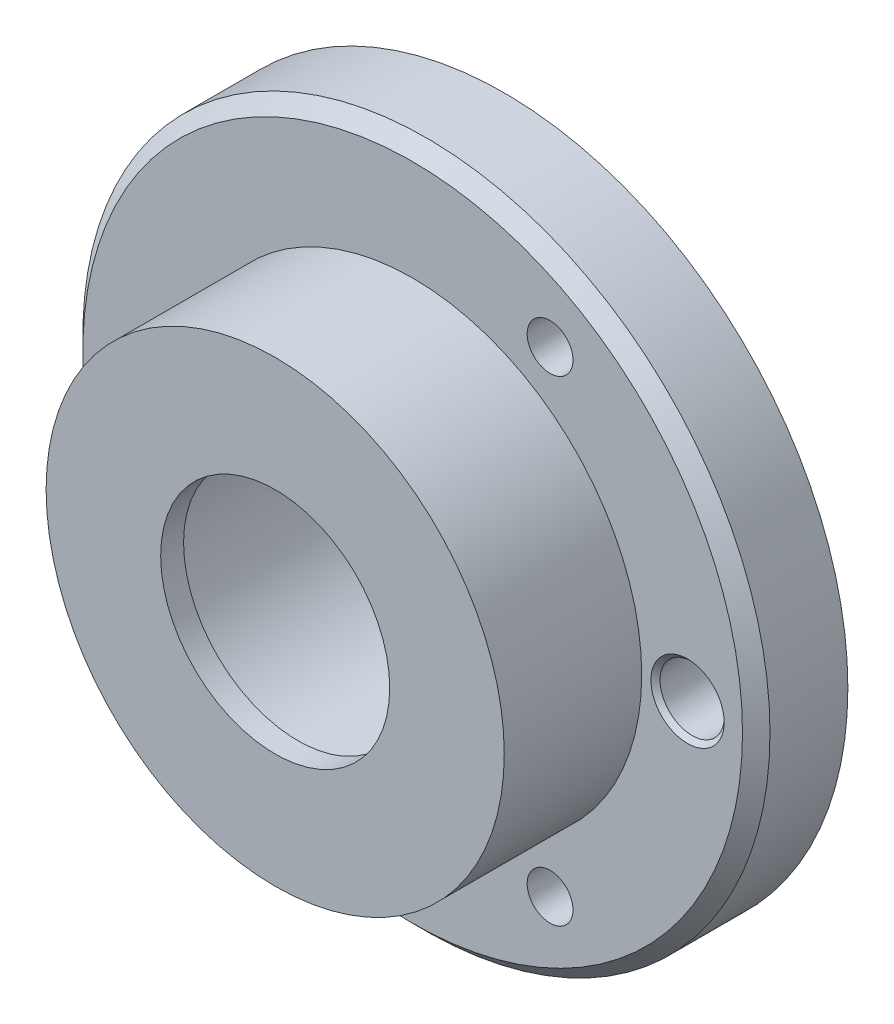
ISO-10303-21;
HEADER;
FILE_DESCRIPTION(('STEP AP214'),'2;1');
FILE_NAME('part.step','',(''),(''),'','','');
FILE_SCHEMA(('AUTOMOTIVE_DESIGN { 1 0 10303 214 1 1 1 1 }'));
ENDSEC;
DATA;
#1=APPLICATION_CONTEXT('core data for automotive mechanical design processes');
#2=APPLICATION_PROTOCOL_DEFINITION('international standard','automotive_design',2000,#1);
#3=PRODUCT_CONTEXT('',#1,'mechanical');
#4=PRODUCT('Part','Part','',(#3));
#5=PRODUCT_RELATED_PRODUCT_CATEGORY('part','',(#4));
#6=PRODUCT_DEFINITION_FORMATION('','',#4);
#7=PRODUCT_DEFINITION_CONTEXT('part definition',#1,'design');
#8=PRODUCT_DEFINITION('design','',#6,#7);
#9=PRODUCT_DEFINITION_SHAPE('','',#8);
#10=(LENGTH_UNIT() NAMED_UNIT(*) SI_UNIT(.MILLI.,.METRE.));
#11=(NAMED_UNIT(*) PLANE_ANGLE_UNIT() SI_UNIT($,.RADIAN.));
#12=(NAMED_UNIT(*) SI_UNIT($,.STERADIAN.) SOLID_ANGLE_UNIT());
#13=UNCERTAINTY_MEASURE_WITH_UNIT(LENGTH_MEASURE(1.E-05),#10,'distance_accuracy_value','');
#14=(GEOMETRIC_REPRESENTATION_CONTEXT(3) GLOBAL_UNCERTAINTY_ASSIGNED_CONTEXT((#13)) GLOBAL_UNIT_ASSIGNED_CONTEXT((#10,
#11,#12)) REPRESENTATION_CONTEXT('',''));
#15=CARTESIAN_POINT('',(0.,0.,0.));
#16=DIRECTION('',(0.,0.,1.));
#17=DIRECTION('',(1.,0.,0.));
#18=AXIS2_PLACEMENT_3D('',#15,#16,#17);
#19=CARTESIAN_POINT('',(0.,0.,-0.00100000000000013));
#20=DIRECTION('',(0.,0.,1.));
#21=DIRECTION('',(1.,0.,0.));
#22=AXIS2_PLACEMENT_3D('',#19,#20,#21);
#23=CYLINDRICAL_SURFACE('',#22,2.5);
#24=CARTESIAN_POINT('',(0.,0.,5.));
#25=DIRECTION('',(0.,0.,1.));
#26=DIRECTION('',(1.,0.,0.));
#27=AXIS2_PLACEMENT_3D('',#24,#25,#26);
#28=CIRCLE('',#27,2.5);
#29=CARTESIAN_POINT('',(2.5,0.,5.));
#30=VERTEX_POINT('',#29);
#31=EDGE_CURVE('E84',#30,#30,#28,.T.);
#32=ORIENTED_EDGE('',*,*,#31,.T.);
#33=EDGE_LOOP('',(#32));
#34=FACE_BOUND('',#33,.T.);
#35=CARTESIAN_POINT('',(0.,0.,4.5));
#36=DIRECTION('',(0.,0.,-1.));
#37=DIRECTION('',(-1.,0.,0.));
#38=AXIS2_PLACEMENT_3D('',#35,#36,#37);
#39=CIRCLE('',#38,2.5);
#40=CARTESIAN_POINT('',(-2.5,0.,4.5));
#41=VERTEX_POINT('',#40);
#42=EDGE_CURVE('E81',#41,#41,#39,.F.);
#43=ORIENTED_EDGE('',*,*,#42,.F.);
#44=EDGE_LOOP('',(#43));
#45=FACE_BOUND('',#44,.T.);
#46=ADVANCED_FACE('F30',(#34,#45),#23,.F.);
#47=CARTESIAN_POINT('',(0.,0.,2.));
#48=DIRECTION('',(0.,0.,1.));
#49=DIRECTION('',(1.,0.,0.));
#50=AXIS2_PLACEMENT_3D('',#47,#48,#49);
#51=PLANE('',#50);
#52=CARTESIAN_POINT('',(6.,0.,2.));
#53=DIRECTION('',(0.,0.,1.));
#54=DIRECTION('',(1.,0.,0.));
#55=AXIS2_PLACEMENT_3D('',#52,#53,#54);
#56=CIRCLE('',#55,0.8);
#57=CARTESIAN_POINT('',(6.8,0.,2.));
#58=VERTEX_POINT('',#57);
#59=EDGE_CURVE('E10',#58,#58,#56,.F.);
#60=ORIENTED_EDGE('',*,*,#59,.T.);
#61=EDGE_LOOP('',(#60));
#62=FACE_BOUND('',#61,.T.);
#63=CARTESIAN_POINT('',(0.,0.,2.));
#64=DIRECTION('',(0.,0.,1.));
#65=DIRECTION('',(1.,0.,0.));
#66=AXIS2_PLACEMENT_3D('',#63,#64,#65);
#67=CIRCLE('',#66,7.2);
#68=CARTESIAN_POINT('',(7.2,0.,2.));
#69=VERTEX_POINT('',#68);
#70=EDGE_CURVE('E77',#69,#69,#67,.T.);
#71=ORIENTED_EDGE('',*,*,#70,.T.);
#72=EDGE_LOOP('',(#71));
#73=FACE_BOUND('',#72,.T.);
#74=CARTESIAN_POINT('',(2.99999999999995,5.19615242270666,2.));
#75=DIRECTION('',(0.,0.,1.));
#76=DIRECTION('',(1.,0.,0.));
#77=AXIS2_PLACEMENT_3D('',#74,#75,#76);
#78=CIRCLE('',#77,0.500000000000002);
#79=CARTESIAN_POINT('',(3.49999999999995,5.19615242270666,2.));
#80=VERTEX_POINT('',#79);
#81=EDGE_CURVE('E104',#80,#80,#78,.T.);
#82=ORIENTED_EDGE('',*,*,#81,.F.);
#83=EDGE_LOOP('',(#82));
#84=FACE_BOUND('',#83,.T.);
#85=CARTESIAN_POINT('',(3.00000000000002,-5.19615242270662,2.));
#86=DIRECTION('',(0.,0.,1.));
#87=DIRECTION('',(1.,0.,0.));
#88=AXIS2_PLACEMENT_3D('',#85,#86,#87);
#89=CIRCLE('',#88,0.500000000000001);
#90=CARTESIAN_POINT('',(3.50000000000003,-5.19615242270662,2.));
#91=VERTEX_POINT('',#90);
#92=EDGE_CURVE('E101',#91,#91,#89,.T.);
#93=ORIENTED_EDGE('',*,*,#92,.F.);
#94=EDGE_LOOP('',(#93));
#95=FACE_BOUND('',#94,.T.);
#96=CARTESIAN_POINT('',(-6.,0.,2.));
#97=DIRECTION('',(0.,0.,1.));
#98=DIRECTION('',(1.,0.,0.));
#99=AXIS2_PLACEMENT_3D('',#96,#97,#98);
#100=CIRCLE('',#99,0.500000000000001);
#101=CARTESIAN_POINT('',(-5.5,0.,2.));
#102=VERTEX_POINT('',#101);
#103=EDGE_CURVE('E98',#102,#102,#100,.T.);
#104=ORIENTED_EDGE('',*,*,#103,.F.);
#105=EDGE_LOOP('',(#104));
#106=FACE_BOUND('',#105,.T.);
#107=CARTESIAN_POINT('',(0.,0.,2.));
#108=DIRECTION('',(0.,0.,1.));
#109=DIRECTION('',(1.,0.,0.));
#110=AXIS2_PLACEMENT_3D('',#107,#108,#109);
#111=CIRCLE('',#110,5.);
#112=CARTESIAN_POINT('',(5.,0.,2.));
#113=VERTEX_POINT('',#112);
#114=EDGE_CURVE('E91',#113,#113,#111,.T.);
#115=ORIENTED_EDGE('',*,*,#114,.F.);
#116=EDGE_LOOP('',(#115));
#117=FACE_BOUND('',#116,.T.);
#118=ADVANCED_FACE('F110',(#62,#73,#84,#95,#106,#117),#51,.T.);
#119=CARTESIAN_POINT('',(0.,0.,2.));
#120=DIRECTION('',(0.,0.,-1.));
#121=DIRECTION('',(-1.,0.,0.));
#122=AXIS2_PLACEMENT_3D('',#119,#120,#121);
#123=CYLINDRICAL_SURFACE('',#122,7.5);
#124=CARTESIAN_POINT('',(0.,0.,1.7));
#125=DIRECTION('',(0.,0.,1.));
#126=DIRECTION('',(1.,0.,0.));
#127=AXIS2_PLACEMENT_3D('',#124,#125,#126);
#128=CIRCLE('',#127,7.5);
#129=CARTESIAN_POINT('',(7.5,0.,1.7));
#130=VERTEX_POINT('',#129);
#131=EDGE_CURVE('E74',#130,#130,#128,.F.);
#132=ORIENTED_EDGE('',*,*,#131,.T.);
#133=EDGE_LOOP('',(#132));
#134=FACE_BOUND('',#133,.T.);
#135=CARTESIAN_POINT('',(0.,0.,0.));
#136=DIRECTION('',(0.,0.,1.));
#137=DIRECTION('',(1.,0.,0.));
#138=AXIS2_PLACEMENT_3D('',#135,#136,#137);
#139=CIRCLE('',#138,7.5);
#140=CARTESIAN_POINT('',(7.5,0.,0.));
#141=VERTEX_POINT('',#140);
#142=EDGE_CURVE('E80',#141,#141,#139,.T.);
#143=ORIENTED_EDGE('',*,*,#142,.T.);
#144=EDGE_LOOP('',(#143));
#145=FACE_BOUND('',#144,.T.);
#146=ADVANCED_FACE('F32',(#134,#145),#123,.T.);
#147=CARTESIAN_POINT('',(0.,0.,0.));
#148=DIRECTION('',(0.,0.,1.));
#149=DIRECTION('',(1.,0.,0.));
#150=AXIS2_PLACEMENT_3D('',#147,#148,#149);
#151=PLANE('',#150);
#152=CARTESIAN_POINT('',(-6.,0.,0.));
#153=DIRECTION('',(0.,0.,1.));
#154=DIRECTION('',(1.,0.,0.));
#155=AXIS2_PLACEMENT_3D('',#152,#153,#154);
#156=CIRCLE('',#155,0.600000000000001);
#157=CARTESIAN_POINT('',(-5.4,0.,0.));
#158=VERTEX_POINT('',#157);
#159=EDGE_CURVE('E53',#158,#158,#156,.T.);
#160=ORIENTED_EDGE('',*,*,#159,.T.);
#161=EDGE_LOOP('',(#160));
#162=FACE_BOUND('',#161,.T.);
#163=CARTESIAN_POINT('',(2.99999999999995,5.19615242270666,0.));
#164=DIRECTION('',(0.,0.,1.));
#165=DIRECTION('',(1.,0.,0.));
#166=AXIS2_PLACEMENT_3D('',#163,#164,#165);
#167=CIRCLE('',#166,0.600000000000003);
#168=CARTESIAN_POINT('',(3.59999999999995,5.19615242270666,0.));
#169=VERTEX_POINT('',#168);
#170=EDGE_CURVE('E56',#169,#169,#167,.T.);
#171=ORIENTED_EDGE('',*,*,#170,.T.);
#172=EDGE_LOOP('',(#171));
#173=FACE_BOUND('',#172,.T.);
#174=CARTESIAN_POINT('',(3.00000000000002,-5.19615242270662,0.));
#175=DIRECTION('',(0.,0.,1.));
#176=DIRECTION('',(1.,0.,0.));
#177=AXIS2_PLACEMENT_3D('',#174,#175,#176);
#178=CIRCLE('',#177,0.600000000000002);
#179=CARTESIAN_POINT('',(3.60000000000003,-5.19615242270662,0.));
#180=VERTEX_POINT('',#179);
#181=EDGE_CURVE('E59',#180,#180,#178,.T.);
#182=ORIENTED_EDGE('',*,*,#181,.T.);
#183=EDGE_LOOP('',(#182));
#184=FACE_BOUND('',#183,.T.);
#185=CARTESIAN_POINT('',(6.,0.,0.));
#186=DIRECTION('',(0.,0.,1.));
#187=DIRECTION('',(1.,0.,0.));
#188=AXIS2_PLACEMENT_3D('',#185,#186,#187);
#189=CIRCLE('',#188,0.799999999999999);
#190=CARTESIAN_POINT('',(6.8,0.,0.));
#191=VERTEX_POINT('',#190);
#192=EDGE_CURVE('E62',#191,#191,#189,.T.);
#193=ORIENTED_EDGE('',*,*,#192,.T.);
#194=EDGE_LOOP('',(#193));
#195=FACE_BOUND('',#194,.T.);
#196=CARTESIAN_POINT('',(0.,0.,0.));
#197=DIRECTION('',(0.,0.,1.));
#198=DIRECTION('',(1.,0.,0.));
#199=AXIS2_PLACEMENT_3D('',#196,#197,#198);
#200=CIRCLE('',#199,3.35);
#201=CARTESIAN_POINT('',(3.35,0.,0.));
#202=VERTEX_POINT('',#201);
#203=EDGE_CURVE('E68',#202,#202,#200,.T.);
#204=ORIENTED_EDGE('',*,*,#203,.T.);
#205=EDGE_LOOP('',(#204));
#206=FACE_BOUND('',#205,.T.);
#207=ORIENTED_EDGE('',*,*,#142,.F.);
#208=EDGE_LOOP('',(#207));
#209=FACE_BOUND('',#208,.T.);
#210=ADVANCED_FACE('F122',(#162,#173,#184,#195,#206,#209),#151,.F.);
#211=CARTESIAN_POINT('',(0.,0.,5.));
#212=DIRECTION('',(0.,0.,-1.));
#213=DIRECTION('',(-1.,0.,0.));
#214=AXIS2_PLACEMENT_3D('',#211,#212,#213);
#215=CYLINDRICAL_SURFACE('',#214,5.);
#216=CARTESIAN_POINT('',(0.,0.,5.));
#217=DIRECTION('',(0.,0.,1.));
#218=DIRECTION('',(1.,0.,0.));
#219=AXIS2_PLACEMENT_3D('',#216,#217,#218);
#220=CIRCLE('',#219,5.);
#221=CARTESIAN_POINT('',(5.,0.,5.));
#222=VERTEX_POINT('',#221);
#223=EDGE_CURVE('E88',#222,#222,#220,.T.);
#224=ORIENTED_EDGE('',*,*,#223,.F.);
#225=EDGE_LOOP('',(#224));
#226=FACE_BOUND('',#225,.T.);
#227=ORIENTED_EDGE('',*,*,#114,.T.);
#228=EDGE_LOOP('',(#227));
#229=FACE_BOUND('',#228,.T.);
#230=ADVANCED_FACE('F119',(#226,#229),#215,.T.);
#231=CARTESIAN_POINT('',(0.,0.,5.));
#232=DIRECTION('',(0.,0.,1.));
#233=DIRECTION('',(1.,0.,0.));
#234=AXIS2_PLACEMENT_3D('',#231,#232,#233);
#235=PLANE('',#234);
#236=ORIENTED_EDGE('',*,*,#31,.F.);
#237=EDGE_LOOP('',(#236));
#238=FACE_BOUND('',#237,.T.);
#239=ORIENTED_EDGE('',*,*,#223,.T.);
#240=EDGE_LOOP('',(#239));
#241=FACE_BOUND('',#240,.T.);
#242=ADVANCED_FACE('F121',(#238,#241),#235,.T.);
#243=CARTESIAN_POINT('',(0.,0.,4.5));
#244=DIRECTION('',(0.,0.,-1.));
#245=DIRECTION('',(-1.,0.,0.));
#246=AXIS2_PLACEMENT_3D('',#243,#244,#245);
#247=PLANE('',#246);
#248=CARTESIAN_POINT('',(0.,0.,4.5));
#249=DIRECTION('',(0.,0.,-1.));
#250=DIRECTION('',(-1.,0.,0.));
#251=AXIS2_PLACEMENT_3D('',#248,#249,#250);
#252=CIRCLE('',#251,3.05);
#253=CARTESIAN_POINT('',(-3.05,0.,4.5));
#254=VERTEX_POINT('',#253);
#255=EDGE_CURVE('E85',#254,#254,#252,.T.);
#256=ORIENTED_EDGE('',*,*,#255,.T.);
#257=EDGE_LOOP('',(#256));
#258=FACE_BOUND('',#257,.T.);
#259=ORIENTED_EDGE('',*,*,#42,.T.);
#260=EDGE_LOOP('',(#259));
#261=FACE_BOUND('',#260,.T.);
#262=ADVANCED_FACE('F129',(#258,#261),#247,.T.);
#263=CARTESIAN_POINT('',(0.,0.,4.5));
#264=DIRECTION('',(0.,0.,-1.));
#265=DIRECTION('',(-1.,0.,0.));
#266=AXIS2_PLACEMENT_3D('',#263,#264,#265);
#267=CYLINDRICAL_SURFACE('',#266,3.05);
#268=CARTESIAN_POINT('',(0.,0.,0.519615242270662));
#269=DIRECTION('',(0.,0.,1.));
#270=DIRECTION('',(1.,0.,0.));
#271=AXIS2_PLACEMENT_3D('',#268,#269,#270);
#272=CIRCLE('',#271,3.05);
#273=CARTESIAN_POINT('',(3.05,0.,0.519615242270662));
#274=VERTEX_POINT('',#273);
#275=EDGE_CURVE('E71',#274,#274,#272,.F.);
#276=ORIENTED_EDGE('',*,*,#275,.T.);
#277=EDGE_LOOP('',(#276));
#278=FACE_BOUND('',#277,.T.);
#279=ORIENTED_EDGE('',*,*,#255,.F.);
#280=EDGE_LOOP('',(#279));
#281=FACE_BOUND('',#280,.T.);
#282=ADVANCED_FACE('F142',(#278,#281),#267,.F.);
#283=CARTESIAN_POINT('',(-6.,0.,5.));
#284=DIRECTION('',(0.,0.,-1.));
#285=DIRECTION('',(-1.,0.,0.));
#286=AXIS2_PLACEMENT_3D('',#283,#284,#285);
#287=CYLINDRICAL_SURFACE('',#286,0.500000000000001);
#288=CARTESIAN_POINT('',(-6.,0.,0.1));
#289=DIRECTION('',(0.,0.,1.));
#290=DIRECTION('',(1.,0.,0.));
#291=AXIS2_PLACEMENT_3D('',#288,#289,#290);
#292=CIRCLE('',#291,0.500000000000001);
#293=CARTESIAN_POINT('',(-5.5,0.,0.1));
#294=VERTEX_POINT('',#293);
#295=EDGE_CURVE('E65',#294,#294,#292,.F.);
#296=ORIENTED_EDGE('',*,*,#295,.T.);
#297=EDGE_LOOP('',(#296));
#298=FACE_BOUND('',#297,.T.);
#299=ORIENTED_EDGE('',*,*,#103,.T.);
#300=EDGE_LOOP('',(#299));
#301=FACE_BOUND('',#300,.T.);
#302=ADVANCED_FACE('F145',(#298,#301),#287,.F.);
#303=CARTESIAN_POINT('',(3.00000000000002,-5.19615242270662,5.));
#304=DIRECTION('',(0.,0.,-1.));
#305=DIRECTION('',(-1.,0.,0.));
#306=AXIS2_PLACEMENT_3D('',#303,#304,#305);
#307=CYLINDRICAL_SURFACE('',#306,0.500000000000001);
#308=CARTESIAN_POINT('',(3.00000000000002,-5.19615242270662,0.1));
#309=DIRECTION('',(0.,0.,1.));
#310=DIRECTION('',(1.,0.,0.));
#311=AXIS2_PLACEMENT_3D('',#308,#309,#310);
#312=CIRCLE('',#311,0.500000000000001);
#313=CARTESIAN_POINT('',(3.50000000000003,-5.19615242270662,0.1));
#314=VERTEX_POINT('',#313);
#315=EDGE_CURVE('E45',#314,#314,#312,.F.);
#316=ORIENTED_EDGE('',*,*,#315,.T.);
#317=EDGE_LOOP('',(#316));
#318=FACE_BOUND('',#317,.T.);
#319=ORIENTED_EDGE('',*,*,#92,.T.);
#320=EDGE_LOOP('',(#319));
#321=FACE_BOUND('',#320,.T.);
#322=ADVANCED_FACE('F152',(#318,#321),#307,.F.);
#323=CARTESIAN_POINT('',(2.99999999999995,5.19615242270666,5.));
#324=DIRECTION('',(0.,0.,-1.));
#325=DIRECTION('',(-1.,0.,0.));
#326=AXIS2_PLACEMENT_3D('',#323,#324,#325);
#327=CYLINDRICAL_SURFACE('',#326,0.500000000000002);
#328=CARTESIAN_POINT('',(2.99999999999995,5.19615242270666,0.1));
#329=DIRECTION('',(0.,0.,1.));
#330=DIRECTION('',(1.,0.,0.));
#331=AXIS2_PLACEMENT_3D('',#328,#329,#330);
#332=CIRCLE('',#331,0.500000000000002);
#333=CARTESIAN_POINT('',(3.49999999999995,5.19615242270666,0.1));
#334=VERTEX_POINT('',#333);
#335=EDGE_CURVE('E50',#334,#334,#332,.F.);
#336=ORIENTED_EDGE('',*,*,#335,.T.);
#337=EDGE_LOOP('',(#336));
#338=FACE_BOUND('',#337,.T.);
#339=ORIENTED_EDGE('',*,*,#81,.T.);
#340=EDGE_LOOP('',(#339));
#341=FACE_BOUND('',#340,.T.);
#342=ADVANCED_FACE('F108',(#338,#341),#327,.F.);
#343=CARTESIAN_POINT('',(6.,0.,5.));
#344=DIRECTION('',(0.,0.,-1.));
#345=DIRECTION('',(-1.,0.,0.));
#346=AXIS2_PLACEMENT_3D('',#343,#344,#345);
#347=CYLINDRICAL_SURFACE('',#346,0.7);
#348=CARTESIAN_POINT('',(6.,0.,1.9));
#349=DIRECTION('',(0.,0.,1.));
#350=DIRECTION('',(1.,0.,0.));
#351=AXIS2_PLACEMENT_3D('',#348,#349,#350);
#352=CIRCLE('',#351,0.7);
#353=CARTESIAN_POINT('',(6.7,0.,1.9));
#354=VERTEX_POINT('',#353);
#355=EDGE_CURVE('E37',#354,#354,#352,.T.);
#356=ORIENTED_EDGE('',*,*,#355,.T.);
#357=EDGE_LOOP('',(#356));
#358=FACE_BOUND('',#357,.T.);
#359=CARTESIAN_POINT('',(6.,0.,0.1));
#360=DIRECTION('',(0.,0.,1.));
#361=DIRECTION('',(1.,0.,0.));
#362=AXIS2_PLACEMENT_3D('',#359,#360,#361);
#363=CIRCLE('',#362,0.7);
#364=CARTESIAN_POINT('',(6.7,0.,0.1));
#365=VERTEX_POINT('',#364);
#366=EDGE_CURVE('E41',#365,#365,#363,.F.);
#367=ORIENTED_EDGE('',*,*,#366,.T.);
#368=EDGE_LOOP('',(#367));
#369=FACE_BOUND('',#368,.T.);
#370=ADVANCED_FACE('F159',(#358,#369),#347,.F.);
#371=CARTESIAN_POINT('',(0.,0.,2.));
#372=DIRECTION('',(0.,0.,-1.));
#373=DIRECTION('',(-1.,0.,0.));
#374=AXIS2_PLACEMENT_3D('',#371,#372,#373);
#375=CONICAL_SURFACE('',#374,7.2,0.785398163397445);
#376=ORIENTED_EDGE('',*,*,#131,.F.);
#377=EDGE_LOOP('',(#376));
#378=FACE_BOUND('',#377,.T.);
#379=ORIENTED_EDGE('',*,*,#70,.F.);
#380=EDGE_LOOP('',(#379));
#381=FACE_BOUND('',#380,.T.);
#382=ADVANCED_FACE('F163',(#378,#381),#375,.T.);
#383=CARTESIAN_POINT('',(0.,0.,0.519615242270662));
#384=DIRECTION('',(0.,0.,-1.));
#385=DIRECTION('',(-1.,0.,0.));
#386=AXIS2_PLACEMENT_3D('',#383,#384,#385);
#387=CONICAL_SURFACE('',#386,3.05,0.523598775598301);
#388=ORIENTED_EDGE('',*,*,#203,.F.);
#389=EDGE_LOOP('',(#388));
#390=FACE_BOUND('',#389,.T.);
#391=ORIENTED_EDGE('',*,*,#275,.F.);
#392=EDGE_LOOP('',(#391));
#393=FACE_BOUND('',#392,.T.);
#394=ADVANCED_FACE('F166',(#390,#393),#387,.F.);
#395=CARTESIAN_POINT('',(-6.,0.,0.1));
#396=DIRECTION('',(0.,0.,-1.));
#397=DIRECTION('',(-1.,0.,0.));
#398=AXIS2_PLACEMENT_3D('',#395,#396,#397);
#399=CONICAL_SURFACE('',#398,0.500000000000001,0.785398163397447);
#400=ORIENTED_EDGE('',*,*,#159,.F.);
#401=EDGE_LOOP('',(#400));
#402=FACE_BOUND('',#401,.T.);
#403=ORIENTED_EDGE('',*,*,#295,.F.);
#404=EDGE_LOOP('',(#403));
#405=FACE_BOUND('',#404,.T.);
#406=ADVANCED_FACE('F170',(#402,#405),#399,.F.);
#407=CARTESIAN_POINT('',(2.99999999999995,5.19615242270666,0.1));
#408=DIRECTION('',(0.,0.,-1.));
#409=DIRECTION('',(-1.,0.,0.));
#410=AXIS2_PLACEMENT_3D('',#407,#408,#409);
#411=CONICAL_SURFACE('',#410,0.500000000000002,0.78539816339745);
#412=ORIENTED_EDGE('',*,*,#170,.F.);
#413=EDGE_LOOP('',(#412));
#414=FACE_BOUND('',#413,.T.);
#415=ORIENTED_EDGE('',*,*,#335,.F.);
#416=EDGE_LOOP('',(#415));
#417=FACE_BOUND('',#416,.T.);
#418=ADVANCED_FACE('F174',(#414,#417),#411,.F.);
#419=CARTESIAN_POINT('',(3.00000000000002,-5.19615242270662,0.1));
#420=DIRECTION('',(0.,0.,-1.));
#421=DIRECTION('',(-1.,0.,0.));
#422=AXIS2_PLACEMENT_3D('',#419,#420,#421);
#423=CONICAL_SURFACE('',#422,0.500000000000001,0.785398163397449);
#424=ORIENTED_EDGE('',*,*,#181,.F.);
#425=EDGE_LOOP('',(#424));
#426=FACE_BOUND('',#425,.T.);
#427=ORIENTED_EDGE('',*,*,#315,.F.);
#428=EDGE_LOOP('',(#427));
#429=FACE_BOUND('',#428,.T.);
#430=ADVANCED_FACE('F178',(#426,#429),#423,.F.);
#431=CARTESIAN_POINT('',(6.,0.,1.9));
#432=DIRECTION('',(0.,0.,1.));
#433=DIRECTION('',(1.,0.,0.));
#434=AXIS2_PLACEMENT_3D('',#431,#432,#433);
#435=CONICAL_SURFACE('',#434,0.7,0.785398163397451);
#436=ORIENTED_EDGE('',*,*,#59,.F.);
#437=EDGE_LOOP('',(#436));
#438=FACE_BOUND('',#437,.T.);
#439=ORIENTED_EDGE('',*,*,#355,.F.);
#440=EDGE_LOOP('',(#439));
#441=FACE_BOUND('',#440,.T.);
#442=ADVANCED_FACE('F182',(#438,#441),#435,.F.);
#443=CARTESIAN_POINT('',(6.,0.,0.1));
#444=DIRECTION('',(0.,0.,-1.));
#445=DIRECTION('',(-1.,0.,0.));
#446=AXIS2_PLACEMENT_3D('',#443,#444,#445);
#447=CONICAL_SURFACE('',#446,0.7,0.785398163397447);
#448=ORIENTED_EDGE('',*,*,#192,.F.);
#449=EDGE_LOOP('',(#448));
#450=FACE_BOUND('',#449,.T.);
#451=ORIENTED_EDGE('',*,*,#366,.F.);
#452=EDGE_LOOP('',(#451));
#453=FACE_BOUND('',#452,.T.);
#454=ADVANCED_FACE('F186',(#450,#453),#447,.F.);
#455=CLOSED_SHELL('',(#46,#118,#146,#210,#230,#242,#262,#282,#302,#322,#342,#370,#382,#394,#406,
#418,#430,#442,#454));
#456=MANIFOLD_SOLID_BREP('B2',#455);
#457=ADVANCED_BREP_SHAPE_REPRESENTATION('',(#18,#456),#14);
#458=SHAPE_DEFINITION_REPRESENTATION(#9,#457);
ENDSEC;
END-ISO-10303-21;
